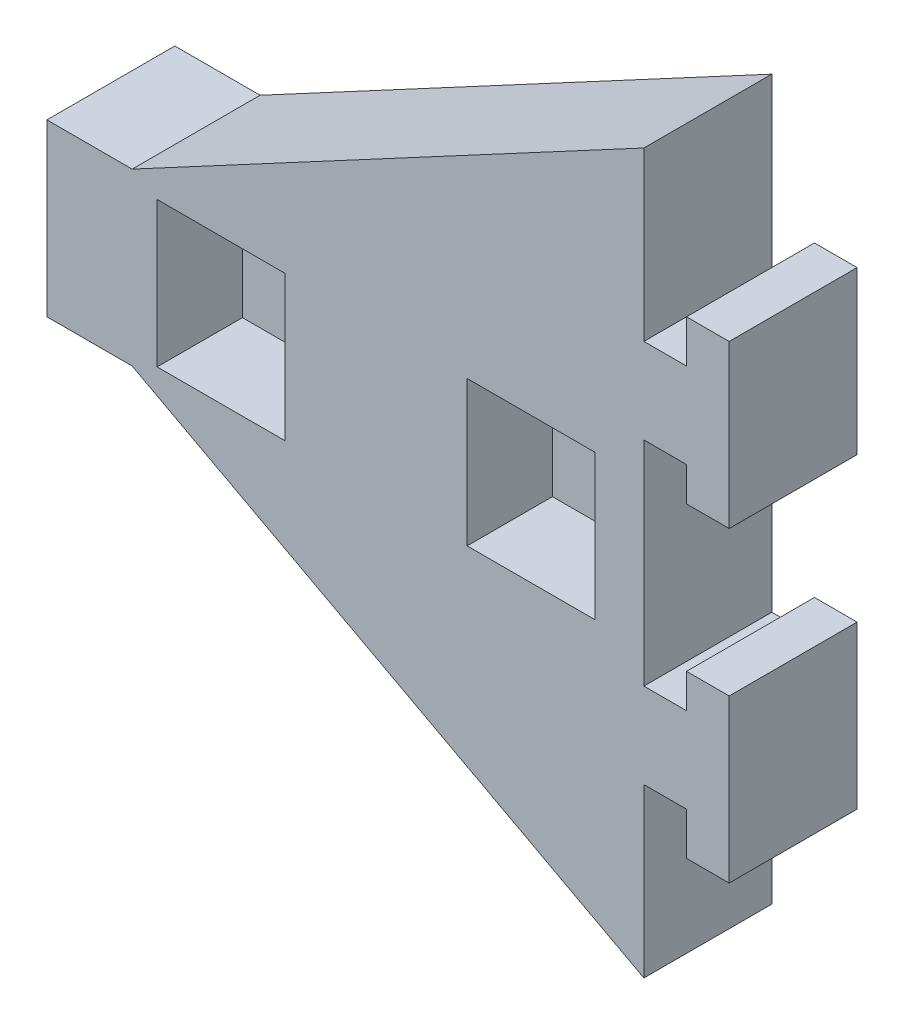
ISO-10303-21;
HEADER;
FILE_DESCRIPTION(('STEP AP214'),'2;1');
FILE_NAME('part.step','',(''),(''),'','','');
FILE_SCHEMA(('AUTOMOTIVE_DESIGN { 1 0 10303 214 1 1 1 1 }'));
ENDSEC;
DATA;
#1=APPLICATION_CONTEXT('core data for automotive mechanical design processes');
#2=APPLICATION_PROTOCOL_DEFINITION('international standard','automotive_design',2000,#1);
#3=PRODUCT_CONTEXT('',#1,'mechanical');
#4=PRODUCT('Part','Part','',(#3));
#5=PRODUCT_RELATED_PRODUCT_CATEGORY('part','',(#4));
#6=PRODUCT_DEFINITION_FORMATION('','',#4);
#7=PRODUCT_DEFINITION_CONTEXT('part definition',#1,'design');
#8=PRODUCT_DEFINITION('design','',#6,#7);
#9=PRODUCT_DEFINITION_SHAPE('','',#8);
#10=(LENGTH_UNIT() NAMED_UNIT(*) SI_UNIT(.MILLI.,.METRE.));
#11=(NAMED_UNIT(*) PLANE_ANGLE_UNIT() SI_UNIT($,.RADIAN.));
#12=(NAMED_UNIT(*) SI_UNIT($,.STERADIAN.) SOLID_ANGLE_UNIT());
#13=UNCERTAINTY_MEASURE_WITH_UNIT(LENGTH_MEASURE(1.E-05),#10,'distance_accuracy_value','');
#14=(GEOMETRIC_REPRESENTATION_CONTEXT(3) GLOBAL_UNCERTAINTY_ASSIGNED_CONTEXT((#13)) GLOBAL_UNIT_ASSIGNED_CONTEXT((#10,
#11,#12)) REPRESENTATION_CONTEXT('',''));
#15=CARTESIAN_POINT('',(0.,0.,0.));
#16=DIRECTION('',(0.,0.,1.));
#17=DIRECTION('',(1.,0.,0.));
#18=AXIS2_PLACEMENT_3D('',#15,#16,#17);
#19=CARTESIAN_POINT('',(70.,0.,15.));
#20=DIRECTION('',(-1.,0.,0.));
#21=DIRECTION('',(0.,-1.,0.));
#22=AXIS2_PLACEMENT_3D('',#19,#20,#21);
#23=PLANE('',#22);
#24=DIRECTION('',(0.,1.,0.));
#25=VECTOR('',#24,1.);
#26=CARTESIAN_POINT('',(70.,0.,15.));
#27=LINE('',#26,#25);
#28=CARTESIAN_POINT('',(70.,-39.,15.));
#29=VERTEX_POINT('',#28);
#30=CARTESIAN_POINT('',(70.,-20.,15.));
#31=VERTEX_POINT('',#30);
#32=EDGE_CURVE('E244',#29,#31,#27,.T.);
#33=ORIENTED_EDGE('',*,*,#32,.F.);
#34=DIRECTION('',(0.,0.,1.));
#35=VECTOR('',#34,1.);
#36=CARTESIAN_POINT('',(70.,-39.,0.));
#37=LINE('',#36,#35);
#38=CARTESIAN_POINT('',(70.,-39.,0.));
#39=VERTEX_POINT('',#38);
#40=EDGE_CURVE('E232',#39,#29,#37,.T.);
#41=ORIENTED_EDGE('',*,*,#40,.F.);
#42=DIRECTION('',(0.,1.,0.));
#43=VECTOR('',#42,1.);
#44=CARTESIAN_POINT('',(70.,0.,0.));
#45=LINE('',#44,#43);
#46=CARTESIAN_POINT('',(70.,-20.,0.));
#47=VERTEX_POINT('',#46);
#48=EDGE_CURVE('E242',#39,#47,#45,.T.);
#49=ORIENTED_EDGE('',*,*,#48,.T.);
#50=DIRECTION('',(0.,0.,1.));
#51=VECTOR('',#50,1.);
#52=CARTESIAN_POINT('',(70.,-20.,0.));
#53=LINE('',#52,#51);
#54=EDGE_CURVE('E304',#47,#31,#53,.T.);
#55=ORIENTED_EDGE('',*,*,#54,.T.);
#56=EDGE_LOOP('',(#33,#41,#49,#55));
#57=FACE_BOUND('',#56,.T.);
#58=ADVANCED_FACE('F34',(#57),#23,.F.);
#59=CARTESIAN_POINT('',(0.,0.,15.));
#60=DIRECTION('',(0.,0.,1.));
#61=DIRECTION('',(1.,0.,0.));
#62=AXIS2_PLACEMENT_3D('',#59,#60,#61);
#63=PLANE('',#62);
#64=DIRECTION('',(-1.,0.,0.));
#65=VECTOR('',#64,1.);
#66=CARTESIAN_POINT('',(70.,-39.,15.));
#67=LINE('',#66,#65);
#68=CARTESIAN_POINT('',(65.,-39.,15.));
#69=VERTEX_POINT('',#68);
#70=EDGE_CURVE('E49',#29,#69,#67,.T.);
#71=ORIENTED_EDGE('',*,*,#70,.F.);
#72=ORIENTED_EDGE('',*,*,#32,.T.);
#73=DIRECTION('',(-1.,0.,0.));
#74=VECTOR('',#73,1.);
#75=CARTESIAN_POINT('',(0.,-20.,15.));
#76=LINE('',#75,#74);
#77=CARTESIAN_POINT('',(65.,-20.,15.));
#78=VERTEX_POINT('',#77);
#79=EDGE_CURVE('E314',#31,#78,#76,.T.);
#80=ORIENTED_EDGE('',*,*,#79,.T.);
#81=DIRECTION('',(0.,1.,0.));
#82=VECTOR('',#81,1.);
#83=CARTESIAN_POINT('',(65.,0.,15.));
#84=LINE('',#83,#82);
#85=CARTESIAN_POINT('',(65.,-25.,15.));
#86=VERTEX_POINT('',#85);
#87=EDGE_CURVE('E317',#86,#78,#84,.T.);
#88=ORIENTED_EDGE('',*,*,#87,.F.);
#89=DIRECTION('',(-1.,0.,0.));
#90=VECTOR('',#89,1.);
#91=CARTESIAN_POINT('',(0.,-25.,15.));
#92=LINE('',#91,#90);
#93=CARTESIAN_POINT('',(60.,-25.,15.));
#94=VERTEX_POINT('',#93);
#95=EDGE_CURVE('E320',#86,#94,#92,.T.);
#96=ORIENTED_EDGE('',*,*,#95,.T.);
#97=DIRECTION('',(0.,1.,0.));
#98=VECTOR('',#97,1.);
#99=CARTESIAN_POINT('',(60.,0.,15.));
#100=LINE('',#99,#98);
#101=CARTESIAN_POINT('',(60.,-5.35714285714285,15.));
#102=VERTEX_POINT('',#101);
#103=EDGE_CURVE('E310',#94,#102,#100,.T.);
#104=ORIENTED_EDGE('',*,*,#103,.T.);
#105=DIRECTION('',(-0.881479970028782,-0.472221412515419,0.));
#106=VECTOR('',#105,1.);
#107=CARTESIAN_POINT('',(70.,0.,15.));
#108=LINE('',#107,#106);
#109=CARTESIAN_POINT('',(0.,-37.5,15.));
#110=VERTEX_POINT('',#109);
#111=EDGE_CURVE('E255',#102,#110,#108,.T.);
#112=ORIENTED_EDGE('',*,*,#111,.T.);
#113=DIRECTION('',(-1.,0.,0.));
#114=VECTOR('',#113,1.);
#115=CARTESIAN_POINT('',(0.,-37.5,15.));
#116=LINE('',#115,#114);
#117=CARTESIAN_POINT('',(-9.99999999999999,-37.5,15.));
#118=VERTEX_POINT('',#117);
#119=EDGE_CURVE('E296',#110,#118,#116,.T.);
#120=ORIENTED_EDGE('',*,*,#119,.T.);
#121=DIRECTION('',(0.,-1.,0.));
#122=VECTOR('',#121,1.);
#123=CARTESIAN_POINT('',(-9.99999999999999,-37.5,15.));
#124=LINE('',#123,#122);
#125=CARTESIAN_POINT('',(-9.99999999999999,-57.5,15.));
#126=VERTEX_POINT('',#125);
#127=EDGE_CURVE('E275',#118,#126,#124,.T.);
#128=ORIENTED_EDGE('',*,*,#127,.T.);
#129=DIRECTION('',(1.,0.,0.));
#130=VECTOR('',#129,1.);
#131=CARTESIAN_POINT('',(0.,-57.5,15.));
#132=LINE('',#131,#130);
#133=CARTESIAN_POINT('',(0.,-57.5,15.));
#134=VERTEX_POINT('',#133);
#135=EDGE_CURVE('E293',#126,#134,#132,.T.);
#136=ORIENTED_EDGE('',*,*,#135,.T.);
#137=DIRECTION('',(0.881479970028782,-0.472221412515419,0.));
#138=VECTOR('',#137,1.);
#139=CARTESIAN_POINT('',(70.,-95.,15.));
#140=LINE('',#139,#138);
#141=CARTESIAN_POINT('',(60.,-89.6428571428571,15.));
#142=VERTEX_POINT('',#141);
#143=EDGE_CURVE('E290',#134,#142,#140,.T.);
#144=ORIENTED_EDGE('',*,*,#143,.T.);
#145=DIRECTION('',(0.,1.,0.));
#146=VECTOR('',#145,1.);
#147=CARTESIAN_POINT('',(60.,0.,15.));
#148=LINE('',#147,#146);
#149=CARTESIAN_POINT('',(60.,-70.,15.));
#150=VERTEX_POINT('',#149);
#151=EDGE_CURVE('E381',#142,#150,#148,.T.);
#152=ORIENTED_EDGE('',*,*,#151,.T.);
#153=DIRECTION('',(-1.,0.,0.));
#154=VECTOR('',#153,1.);
#155=CARTESIAN_POINT('',(0.,-70.,15.));
#156=LINE('',#155,#154);
#157=CARTESIAN_POINT('',(65.,-70.,15.));
#158=VERTEX_POINT('',#157);
#159=EDGE_CURVE('E384',#158,#150,#156,.T.);
#160=ORIENTED_EDGE('',*,*,#159,.F.);
#161=DIRECTION('',(0.,1.,0.));
#162=VECTOR('',#161,1.);
#163=CARTESIAN_POINT('',(65.,0.,15.));
#164=LINE('',#163,#162);
#165=CARTESIAN_POINT('',(65.,-75.,15.));
#166=VERTEX_POINT('',#165);
#167=EDGE_CURVE('E338',#166,#158,#164,.T.);
#168=ORIENTED_EDGE('',*,*,#167,.F.);
#169=DIRECTION('',(-1.,0.,0.));
#170=VECTOR('',#169,1.);
#171=CARTESIAN_POINT('',(0.,-75.,15.));
#172=LINE('',#171,#170);
#173=CARTESIAN_POINT('',(70.,-75.,15.));
#174=VERTEX_POINT('',#173);
#175=EDGE_CURVE('E377',#174,#166,#172,.T.);
#176=ORIENTED_EDGE('',*,*,#175,.F.);
#177=CARTESIAN_POINT('',(70.,-56.,15.));
#178=VERTEX_POINT('',#177);
#179=EDGE_CURVE('E265',#174,#178,#27,.T.);
#180=ORIENTED_EDGE('',*,*,#179,.T.);
#181=DIRECTION('',(1.,0.,0.));
#182=VECTOR('',#181,1.);
#183=CARTESIAN_POINT('',(70.,-56.,15.));
#184=LINE('',#183,#182);
#185=CARTESIAN_POINT('',(65.,-56.,15.));
#186=VERTEX_POINT('',#185);
#187=EDGE_CURVE('E465',#186,#178,#184,.T.);
#188=ORIENTED_EDGE('',*,*,#187,.F.);
#189=DIRECTION('',(0.,1.,0.));
#190=VECTOR('',#189,1.);
#191=CARTESIAN_POINT('',(65.,0.,15.));
#192=LINE('',#191,#190);
#193=CARTESIAN_POINT('',(65.,-60.,15.));
#194=VERTEX_POINT('',#193);
#195=EDGE_CURVE('E339',#194,#186,#192,.T.);
#196=ORIENTED_EDGE('',*,*,#195,.F.);
#197=DIRECTION('',(-1.,0.,0.));
#198=VECTOR('',#197,1.);
#199=CARTESIAN_POINT('',(0.,-60.,15.));
#200=LINE('',#199,#198);
#201=CARTESIAN_POINT('',(60.,-60.,15.));
#202=VERTEX_POINT('',#201);
#203=EDGE_CURVE('E343',#194,#202,#200,.T.);
#204=ORIENTED_EDGE('',*,*,#203,.T.);
#205=DIRECTION('',(0.,1.,0.));
#206=VECTOR('',#205,1.);
#207=CARTESIAN_POINT('',(60.,0.,15.));
#208=LINE('',#207,#206);
#209=CARTESIAN_POINT('',(60.,-35.,15.));
#210=VERTEX_POINT('',#209);
#211=EDGE_CURVE('E346',#202,#210,#208,.T.);
#212=ORIENTED_EDGE('',*,*,#211,.T.);
#213=DIRECTION('',(1.,0.,0.));
#214=VECTOR('',#213,1.);
#215=CARTESIAN_POINT('',(0.,-35.,15.));
#216=LINE('',#215,#214);
#217=CARTESIAN_POINT('',(65.,-35.,15.));
#218=VERTEX_POINT('',#217);
#219=EDGE_CURVE('E349',#210,#218,#216,.T.);
#220=ORIENTED_EDGE('',*,*,#219,.T.);
#221=DIRECTION('',(0.,-1.,0.));
#222=VECTOR('',#221,1.);
#223=CARTESIAN_POINT('',(65.,0.,15.));
#224=LINE('',#223,#222);
#225=EDGE_CURVE('E352',#218,#69,#224,.T.);
#226=ORIENTED_EDGE('',*,*,#225,.T.);
#227=EDGE_LOOP('',(#71,#72,#80,#88,#96,#104,#112,#120,#128,#136,#144,#152,#160,#168,#176,#180,
#188,#196,#204,#212,#220,#226));
#228=FACE_BOUND('',#227,.T.);
#229=DIRECTION('',(-1.,0.,0.));
#230=VECTOR('',#229,1.);
#231=CARTESIAN_POINT('',(54.274648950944,-39.1236593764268,15.));
#232=LINE('',#231,#230);
#233=CARTESIAN_POINT('',(54.274648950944,-39.1236593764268,15.));
#234=VERTEX_POINT('',#233);
#235=CARTESIAN_POINT('',(39.274648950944,-39.1236593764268,15.));
#236=VERTEX_POINT('',#235);
#237=EDGE_CURVE('E448',#234,#236,#232,.T.);
#238=ORIENTED_EDGE('',*,*,#237,.F.);
#239=DIRECTION('',(0.,1.,0.));
#240=VECTOR('',#239,1.);
#241=CARTESIAN_POINT('',(54.274648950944,-39.1236593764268,15.));
#242=LINE('',#241,#240);
#243=CARTESIAN_POINT('',(54.274648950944,-56.1236593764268,15.));
#244=VERTEX_POINT('',#243);
#245=EDGE_CURVE('E438',#244,#234,#242,.T.);
#246=ORIENTED_EDGE('',*,*,#245,.F.);
#247=DIRECTION('',(1.,0.,0.));
#248=VECTOR('',#247,1.);
#249=CARTESIAN_POINT('',(54.274648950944,-56.1236593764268,15.));
#250=LINE('',#249,#248);
#251=CARTESIAN_POINT('',(39.274648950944,-56.1236593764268,15.));
#252=VERTEX_POINT('',#251);
#253=EDGE_CURVE('E442',#252,#244,#250,.T.);
#254=ORIENTED_EDGE('',*,*,#253,.F.);
#255=DIRECTION('',(0.,-1.,0.));
#256=VECTOR('',#255,1.);
#257=CARTESIAN_POINT('',(39.274648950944,-39.1236593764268,15.));
#258=LINE('',#257,#256);
#259=EDGE_CURVE('E445',#236,#252,#258,.T.);
#260=ORIENTED_EDGE('',*,*,#259,.F.);
#261=EDGE_LOOP('',(#238,#246,#254,#260));
#262=FACE_BOUND('',#261,.T.);
#263=DIRECTION('',(-1.,0.,0.));
#264=VECTOR('',#263,1.);
#265=CARTESIAN_POINT('',(2.92422536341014,-39.1236593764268,15.));
#266=LINE('',#265,#264);
#267=CARTESIAN_POINT('',(17.9242253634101,-39.1236593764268,15.));
#268=VERTEX_POINT('',#267);
#269=CARTESIAN_POINT('',(2.92422536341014,-39.1236593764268,15.));
#270=VERTEX_POINT('',#269);
#271=EDGE_CURVE('E407',#268,#270,#266,.T.);
#272=ORIENTED_EDGE('',*,*,#271,.F.);
#273=DIRECTION('',(0.,1.,0.));
#274=VECTOR('',#273,1.);
#275=CARTESIAN_POINT('',(17.9242253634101,-39.1236593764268,15.));
#276=LINE('',#275,#274);
#277=CARTESIAN_POINT('',(17.9242253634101,-56.1236593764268,15.));
#278=VERTEX_POINT('',#277);
#279=EDGE_CURVE('E410',#278,#268,#276,.T.);
#280=ORIENTED_EDGE('',*,*,#279,.F.);
#281=DIRECTION('',(1.,0.,0.));
#282=VECTOR('',#281,1.);
#283=CARTESIAN_POINT('',(2.92422536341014,-56.1236593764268,15.));
#284=LINE('',#283,#282);
#285=CARTESIAN_POINT('',(2.92422536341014,-56.1236593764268,15.));
#286=VERTEX_POINT('',#285);
#287=EDGE_CURVE('E413',#286,#278,#284,.T.);
#288=ORIENTED_EDGE('',*,*,#287,.F.);
#289=DIRECTION('',(0.,-1.,0.));
#290=VECTOR('',#289,1.);
#291=CARTESIAN_POINT('',(2.92422536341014,-47.6236593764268,15.));
#292=LINE('',#291,#290);
#293=EDGE_CURVE('E416',#270,#286,#292,.T.);
#294=ORIENTED_EDGE('',*,*,#293,.F.);
#295=EDGE_LOOP('',(#272,#280,#288,#294));
#296=FACE_BOUND('',#295,.T.);
#297=ADVANCED_FACE('F474',(#228,#262,#296),#63,.T.);
#298=CARTESIAN_POINT('',(0.,0.,0.));
#299=DIRECTION('',(0.,0.,1.));
#300=DIRECTION('',(1.,0.,0.));
#301=AXIS2_PLACEMENT_3D('',#298,#299,#300);
#302=PLANE('',#301);
#303=ORIENTED_EDGE('',*,*,#48,.F.);
#304=DIRECTION('',(-1.,0.,0.));
#305=VECTOR('',#304,1.);
#306=CARTESIAN_POINT('',(70.,-39.,0.));
#307=LINE('',#306,#305);
#308=CARTESIAN_POINT('',(65.,-39.,0.));
#309=VERTEX_POINT('',#308);
#310=EDGE_CURVE('E229',#39,#309,#307,.T.);
#311=ORIENTED_EDGE('',*,*,#310,.T.);
#312=DIRECTION('',(0.,-1.,0.));
#313=VECTOR('',#312,1.);
#314=CARTESIAN_POINT('',(65.,0.,0.));
#315=LINE('',#314,#313);
#316=CARTESIAN_POINT('',(65.,-35.,0.));
#317=VERTEX_POINT('',#316);
#318=EDGE_CURVE('E342',#317,#309,#315,.T.);
#319=ORIENTED_EDGE('',*,*,#318,.F.);
#320=DIRECTION('',(1.,0.,0.));
#321=VECTOR('',#320,1.);
#322=CARTESIAN_POINT('',(0.,-35.,0.));
#323=LINE('',#322,#321);
#324=CARTESIAN_POINT('',(60.,-35.,0.));
#325=VERTEX_POINT('',#324);
#326=EDGE_CURVE('E363',#325,#317,#323,.T.);
#327=ORIENTED_EDGE('',*,*,#326,.F.);
#328=DIRECTION('',(0.,1.,0.));
#329=VECTOR('',#328,1.);
#330=CARTESIAN_POINT('',(60.,0.,0.));
#331=LINE('',#330,#329);
#332=CARTESIAN_POINT('',(60.,-60.,0.));
#333=VERTEX_POINT('',#332);
#334=EDGE_CURVE('E360',#333,#325,#331,.T.);
#335=ORIENTED_EDGE('',*,*,#334,.F.);
#336=DIRECTION('',(-1.,0.,0.));
#337=VECTOR('',#336,1.);
#338=CARTESIAN_POINT('',(0.,-60.,0.));
#339=LINE('',#338,#337);
#340=CARTESIAN_POINT('',(65.,-60.,0.));
#341=VERTEX_POINT('',#340);
#342=EDGE_CURVE('E358',#341,#333,#339,.T.);
#343=ORIENTED_EDGE('',*,*,#342,.F.);
#344=DIRECTION('',(0.,1.,0.));
#345=VECTOR('',#344,1.);
#346=CARTESIAN_POINT('',(65.,0.,0.));
#347=LINE('',#346,#345);
#348=CARTESIAN_POINT('',(65.,-56.,0.));
#349=VERTEX_POINT('',#348);
#350=EDGE_CURVE('E332',#341,#349,#347,.T.);
#351=ORIENTED_EDGE('',*,*,#350,.T.);
#352=DIRECTION('',(1.,0.,0.));
#353=VECTOR('',#352,1.);
#354=CARTESIAN_POINT('',(70.,-56.,0.));
#355=LINE('',#354,#353);
#356=CARTESIAN_POINT('',(70.,-56.,0.));
#357=VERTEX_POINT('',#356);
#358=EDGE_CURVE('E57',#349,#357,#355,.T.);
#359=ORIENTED_EDGE('',*,*,#358,.T.);
#360=CARTESIAN_POINT('',(70.,-75.,0.));
#361=VERTEX_POINT('',#360);
#362=EDGE_CURVE('E251',#361,#357,#45,.T.);
#363=ORIENTED_EDGE('',*,*,#362,.F.);
#364=DIRECTION('',(-1.,0.,0.));
#365=VECTOR('',#364,1.);
#366=CARTESIAN_POINT('',(0.,-75.,0.));
#367=LINE('',#366,#365);
#368=CARTESIAN_POINT('',(65.,-75.,0.));
#369=VERTEX_POINT('',#368);
#370=EDGE_CURVE('E369',#361,#369,#367,.T.);
#371=ORIENTED_EDGE('',*,*,#370,.T.);
#372=DIRECTION('',(0.,1.,0.));
#373=VECTOR('',#372,1.);
#374=CARTESIAN_POINT('',(65.,0.,0.));
#375=LINE('',#374,#373);
#376=CARTESIAN_POINT('',(65.,-70.,0.));
#377=VERTEX_POINT('',#376);
#378=EDGE_CURVE('E380',#369,#377,#375,.T.);
#379=ORIENTED_EDGE('',*,*,#378,.T.);
#380=DIRECTION('',(-1.,0.,0.));
#381=VECTOR('',#380,1.);
#382=CARTESIAN_POINT('',(0.,-70.,0.));
#383=LINE('',#382,#381);
#384=CARTESIAN_POINT('',(60.,-70.,0.));
#385=VERTEX_POINT('',#384);
#386=EDGE_CURVE('E393',#377,#385,#383,.T.);
#387=ORIENTED_EDGE('',*,*,#386,.T.);
#388=DIRECTION('',(0.,1.,0.));
#389=VECTOR('',#388,1.);
#390=CARTESIAN_POINT('',(60.,0.,0.));
#391=LINE('',#390,#389);
#392=CARTESIAN_POINT('',(60.,-89.6428571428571,0.));
#393=VERTEX_POINT('',#392);
#394=EDGE_CURVE('E391',#393,#385,#391,.T.);
#395=ORIENTED_EDGE('',*,*,#394,.F.);
#396=DIRECTION('',(0.881479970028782,-0.472221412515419,0.));
#397=VECTOR('',#396,1.);
#398=CARTESIAN_POINT('',(70.,-95.,0.));
#399=LINE('',#398,#397);
#400=CARTESIAN_POINT('',(0.,-57.5,0.));
#401=VERTEX_POINT('',#400);
#402=EDGE_CURVE('E252',#401,#393,#399,.T.);
#403=ORIENTED_EDGE('',*,*,#402,.F.);
#404=DIRECTION('',(1.,0.,0.));
#405=VECTOR('',#404,1.);
#406=CARTESIAN_POINT('',(0.,-57.5,0.));
#407=LINE('',#406,#405);
#408=CARTESIAN_POINT('',(-9.99999999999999,-57.5,0.));
#409=VERTEX_POINT('',#408);
#410=EDGE_CURVE('E257',#409,#401,#407,.T.);
#411=ORIENTED_EDGE('',*,*,#410,.F.);
#412=DIRECTION('',(0.,-1.,0.));
#413=VECTOR('',#412,1.);
#414=CARTESIAN_POINT('',(-9.99999999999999,-37.5,0.));
#415=LINE('',#414,#413);
#416=CARTESIAN_POINT('',(-9.99999999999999,-37.5,0.));
#417=VERTEX_POINT('',#416);
#418=EDGE_CURVE('E274',#417,#409,#415,.T.);
#419=ORIENTED_EDGE('',*,*,#418,.F.);
#420=DIRECTION('',(-1.,0.,0.));
#421=VECTOR('',#420,1.);
#422=CARTESIAN_POINT('',(0.,-37.5,0.));
#423=LINE('',#422,#421);
#424=CARTESIAN_POINT('',(0.,-37.5,0.));
#425=VERTEX_POINT('',#424);
#426=EDGE_CURVE('E281',#425,#417,#423,.T.);
#427=ORIENTED_EDGE('',*,*,#426,.F.);
#428=DIRECTION('',(-0.881479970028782,-0.472221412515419,0.));
#429=VECTOR('',#428,1.);
#430=CARTESIAN_POINT('',(70.,0.,0.));
#431=LINE('',#430,#429);
#432=CARTESIAN_POINT('',(60.,-5.35714285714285,0.));
#433=VERTEX_POINT('',#432);
#434=EDGE_CURVE('E284',#433,#425,#431,.T.);
#435=ORIENTED_EDGE('',*,*,#434,.F.);
#436=DIRECTION('',(0.,1.,0.));
#437=VECTOR('',#436,1.);
#438=CARTESIAN_POINT('',(60.,0.,0.));
#439=LINE('',#438,#437);
#440=CARTESIAN_POINT('',(60.,-25.,0.));
#441=VERTEX_POINT('',#440);
#442=EDGE_CURVE('E302',#441,#433,#439,.T.);
#443=ORIENTED_EDGE('',*,*,#442,.F.);
#444=DIRECTION('',(-1.,0.,0.));
#445=VECTOR('',#444,1.);
#446=CARTESIAN_POINT('',(0.,-25.,0.));
#447=LINE('',#446,#445);
#448=CARTESIAN_POINT('',(65.,-25.,0.));
#449=VERTEX_POINT('',#448);
#450=EDGE_CURVE('E313',#449,#441,#447,.T.);
#451=ORIENTED_EDGE('',*,*,#450,.F.);
#452=DIRECTION('',(0.,1.,0.));
#453=VECTOR('',#452,1.);
#454=CARTESIAN_POINT('',(65.,0.,0.));
#455=LINE('',#454,#453);
#456=CARTESIAN_POINT('',(65.,-20.,0.));
#457=VERTEX_POINT('',#456);
#458=EDGE_CURVE('E326',#449,#457,#455,.T.);
#459=ORIENTED_EDGE('',*,*,#458,.T.);
#460=DIRECTION('',(-1.,0.,0.));
#461=VECTOR('',#460,1.);
#462=CARTESIAN_POINT('',(0.,-20.,0.));
#463=LINE('',#462,#461);
#464=EDGE_CURVE('E250',#47,#457,#463,.T.);
#465=ORIENTED_EDGE('',*,*,#464,.F.);
#466=EDGE_LOOP('',(#303,#311,#319,#327,#335,#343,#351,#359,#363,#371,#379,#387,#395,#403,#411,
#419,#427,#435,#443,#451,#459,#465));
#467=FACE_BOUND('',#466,.T.);
#468=ADVANCED_FACE('F247',(#467),#302,.F.);
#469=CARTESIAN_POINT('',(70.,-95.,15.));
#470=DIRECTION('',(0.472221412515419,0.881479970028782,0.));
#471=DIRECTION('',(-0.881479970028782,0.472221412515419,0.));
#472=AXIS2_PLACEMENT_3D('',#469,#470,#471);
#473=PLANE('',#472);
#474=DIRECTION('',(0.,0.,1.));
#475=VECTOR('',#474,1.);
#476=CARTESIAN_POINT('',(60.,-89.6428571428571,0.));
#477=LINE('',#476,#475);
#478=EDGE_CURVE('E371',#393,#142,#477,.T.);
#479=ORIENTED_EDGE('',*,*,#478,.T.);
#480=ORIENTED_EDGE('',*,*,#143,.F.);
#481=DIRECTION('',(0.,0.,-1.));
#482=VECTOR('',#481,1.);
#483=CARTESIAN_POINT('',(0.,-57.5,15.));
#484=LINE('',#483,#482);
#485=EDGE_CURVE('E261',#134,#401,#484,.T.);
#486=ORIENTED_EDGE('',*,*,#485,.T.);
#487=ORIENTED_EDGE('',*,*,#402,.T.);
#488=EDGE_LOOP('',(#479,#480,#486,#487));
#489=FACE_BOUND('',#488,.T.);
#490=ADVANCED_FACE('F517',(#489),#473,.F.);
#491=CARTESIAN_POINT('',(70.,0.,15.));
#492=DIRECTION('',(0.472221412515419,-0.881479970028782,0.));
#493=DIRECTION('',(0.881479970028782,0.472221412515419,0.));
#494=AXIS2_PLACEMENT_3D('',#491,#492,#493);
#495=PLANE('',#494);
#496=DIRECTION('',(0.,0.,1.));
#497=VECTOR('',#496,1.);
#498=CARTESIAN_POINT('',(60.,-5.35714285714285,0.));
#499=LINE('',#498,#497);
#500=EDGE_CURVE('E306',#433,#102,#499,.T.);
#501=ORIENTED_EDGE('',*,*,#500,.F.);
#502=ORIENTED_EDGE('',*,*,#434,.T.);
#503=DIRECTION('',(0.,0.,-1.));
#504=VECTOR('',#503,1.);
#505=CARTESIAN_POINT('',(0.,-37.5,15.));
#506=LINE('',#505,#504);
#507=EDGE_CURVE('E11',#110,#425,#506,.T.);
#508=ORIENTED_EDGE('',*,*,#507,.F.);
#509=ORIENTED_EDGE('',*,*,#111,.F.);
#510=EDGE_LOOP('',(#501,#502,#508,#509));
#511=FACE_BOUND('',#510,.T.);
#512=ADVANCED_FACE('F36',(#511),#495,.F.);
#513=ORIENTED_EDGE('',*,*,#362,.T.);
#514=DIRECTION('',(0.,0.,1.));
#515=VECTOR('',#514,1.);
#516=CARTESIAN_POINT('',(70.,-56.,0.));
#517=LINE('',#516,#515);
#518=EDGE_CURVE('E450',#357,#178,#517,.T.);
#519=ORIENTED_EDGE('',*,*,#518,.T.);
#520=ORIENTED_EDGE('',*,*,#179,.F.);
#521=DIRECTION('',(0.,0.,1.));
#522=VECTOR('',#521,1.);
#523=CARTESIAN_POINT('',(70.,-75.,0.));
#524=LINE('',#523,#522);
#525=EDGE_CURVE('E374',#361,#174,#524,.T.);
#526=ORIENTED_EDGE('',*,*,#525,.F.);
#527=EDGE_LOOP('',(#513,#519,#520,#526));
#528=FACE_BOUND('',#527,.T.);
#529=ADVANCED_FACE('F496',(#528),#23,.F.);
#530=CARTESIAN_POINT('',(0.,-37.5,15.));
#531=DIRECTION('',(0.,-1.,0.));
#532=DIRECTION('',(0.,0.,-1.));
#533=AXIS2_PLACEMENT_3D('',#530,#531,#532);
#534=PLANE('',#533);
#535=ORIENTED_EDGE('',*,*,#426,.T.);
#536=DIRECTION('',(0.,0.,-1.));
#537=VECTOR('',#536,1.);
#538=CARTESIAN_POINT('',(-9.99999999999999,-37.5,15.));
#539=LINE('',#538,#537);
#540=EDGE_CURVE('E42',#118,#417,#539,.T.);
#541=ORIENTED_EDGE('',*,*,#540,.F.);
#542=ORIENTED_EDGE('',*,*,#119,.F.);
#543=ORIENTED_EDGE('',*,*,#507,.T.);
#544=EDGE_LOOP('',(#535,#541,#542,#543));
#545=FACE_BOUND('',#544,.T.);
#546=ADVANCED_FACE('F532',(#545),#534,.F.);
#547=CARTESIAN_POINT('',(-9.99999999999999,-37.5,15.));
#548=DIRECTION('',(1.,0.,0.));
#549=DIRECTION('',(0.,0.,-1.));
#550=AXIS2_PLACEMENT_3D('',#547,#548,#549);
#551=PLANE('',#550);
#552=ORIENTED_EDGE('',*,*,#418,.T.);
#553=DIRECTION('',(0.,0.,-1.));
#554=VECTOR('',#553,1.);
#555=CARTESIAN_POINT('',(-9.99999999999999,-57.5,15.));
#556=LINE('',#555,#554);
#557=EDGE_CURVE('E264',#126,#409,#556,.T.);
#558=ORIENTED_EDGE('',*,*,#557,.F.);
#559=ORIENTED_EDGE('',*,*,#127,.F.);
#560=ORIENTED_EDGE('',*,*,#540,.T.);
#561=EDGE_LOOP('',(#552,#558,#559,#560));
#562=FACE_BOUND('',#561,.T.);
#563=ADVANCED_FACE('F272',(#562),#551,.F.);
#564=CARTESIAN_POINT('',(0.,-57.5,15.));
#565=DIRECTION('',(0.,1.,0.));
#566=DIRECTION('',(0.,0.,1.));
#567=AXIS2_PLACEMENT_3D('',#564,#565,#566);
#568=PLANE('',#567);
#569=ORIENTED_EDGE('',*,*,#410,.T.);
#570=ORIENTED_EDGE('',*,*,#485,.F.);
#571=ORIENTED_EDGE('',*,*,#135,.F.);
#572=ORIENTED_EDGE('',*,*,#557,.T.);
#573=EDGE_LOOP('',(#569,#570,#571,#572));
#574=FACE_BOUND('',#573,.T.);
#575=ADVANCED_FACE('F521',(#574),#568,.F.);
#576=CARTESIAN_POINT('',(0.,-25.,0.));
#577=DIRECTION('',(0.,1.,0.));
#578=DIRECTION('',(0.,0.,1.));
#579=AXIS2_PLACEMENT_3D('',#576,#577,#578);
#580=PLANE('',#579);
#581=ORIENTED_EDGE('',*,*,#95,.F.);
#582=DIRECTION('',(0.,0.,1.));
#583=VECTOR('',#582,1.);
#584=CARTESIAN_POINT('',(65.,-25.,0.));
#585=LINE('',#584,#583);
#586=EDGE_CURVE('E299',#449,#86,#585,.T.);
#587=ORIENTED_EDGE('',*,*,#586,.F.);
#588=ORIENTED_EDGE('',*,*,#450,.T.);
#589=DIRECTION('',(0.,0.,1.));
#590=VECTOR('',#589,1.);
#591=CARTESIAN_POINT('',(60.,-25.,0.));
#592=LINE('',#591,#590);
#593=EDGE_CURVE('E288',#441,#94,#592,.T.);
#594=ORIENTED_EDGE('',*,*,#593,.T.);
#595=EDGE_LOOP('',(#581,#587,#588,#594));
#596=FACE_BOUND('',#595,.T.);
#597=ADVANCED_FACE('F523',(#596),#580,.T.);
#598=CARTESIAN_POINT('',(60.,0.,0.));
#599=DIRECTION('',(1.,0.,0.));
#600=DIRECTION('',(0.,1.,0.));
#601=AXIS2_PLACEMENT_3D('',#598,#599,#600);
#602=PLANE('',#601);
#603=ORIENTED_EDGE('',*,*,#103,.F.);
#604=ORIENTED_EDGE('',*,*,#593,.F.);
#605=ORIENTED_EDGE('',*,*,#442,.T.);
#606=ORIENTED_EDGE('',*,*,#500,.T.);
#607=EDGE_LOOP('',(#603,#604,#605,#606));
#608=FACE_BOUND('',#607,.T.);
#609=ADVANCED_FACE('F529',(#608),#602,.T.);
#610=CARTESIAN_POINT('',(0.,-20.,0.));
#611=DIRECTION('',(0.,1.,0.));
#612=DIRECTION('',(0.,0.,1.));
#613=AXIS2_PLACEMENT_3D('',#610,#611,#612);
#614=PLANE('',#613);
#615=ORIENTED_EDGE('',*,*,#79,.F.);
#616=ORIENTED_EDGE('',*,*,#54,.F.);
#617=ORIENTED_EDGE('',*,*,#464,.T.);
#618=DIRECTION('',(0.,0.,1.));
#619=VECTOR('',#618,1.);
#620=CARTESIAN_POINT('',(65.,-20.,0.));
#621=LINE('',#620,#619);
#622=EDGE_CURVE('E301',#457,#78,#621,.T.);
#623=ORIENTED_EDGE('',*,*,#622,.T.);
#624=EDGE_LOOP('',(#615,#616,#617,#623));
#625=FACE_BOUND('',#624,.T.);
#626=ADVANCED_FACE('F565',(#625),#614,.T.);
#627=CARTESIAN_POINT('',(65.,0.,0.));
#628=DIRECTION('',(1.,0.,0.));
#629=DIRECTION('',(0.,0.,-1.));
#630=AXIS2_PLACEMENT_3D('',#627,#628,#629);
#631=PLANE('',#630);
#632=ORIENTED_EDGE('',*,*,#87,.T.);
#633=ORIENTED_EDGE('',*,*,#622,.F.);
#634=ORIENTED_EDGE('',*,*,#458,.F.);
#635=ORIENTED_EDGE('',*,*,#586,.T.);
#636=EDGE_LOOP('',(#632,#633,#634,#635));
#637=FACE_BOUND('',#636,.T.);
#638=ADVANCED_FACE('F562',(#637),#631,.F.);
#639=CARTESIAN_POINT('',(65.,0.,0.));
#640=DIRECTION('',(1.,0.,0.));
#641=DIRECTION('',(0.,0.,-1.));
#642=AXIS2_PLACEMENT_3D('',#639,#640,#641);
#643=PLANE('',#642);
#644=ORIENTED_EDGE('',*,*,#167,.T.);
#645=DIRECTION('',(0.,0.,1.));
#646=VECTOR('',#645,1.);
#647=CARTESIAN_POINT('',(65.,-70.,0.));
#648=LINE('',#647,#646);
#649=EDGE_CURVE('E366',#377,#158,#648,.T.);
#650=ORIENTED_EDGE('',*,*,#649,.F.);
#651=ORIENTED_EDGE('',*,*,#378,.F.);
#652=DIRECTION('',(0.,0.,1.));
#653=VECTOR('',#652,1.);
#654=CARTESIAN_POINT('',(65.,-75.,0.));
#655=LINE('',#654,#653);
#656=EDGE_CURVE('E323',#369,#166,#655,.T.);
#657=ORIENTED_EDGE('',*,*,#656,.T.);
#658=EDGE_LOOP('',(#644,#650,#651,#657));
#659=FACE_BOUND('',#658,.T.);
#660=ADVANCED_FACE('F506',(#659),#643,.F.);
#661=CARTESIAN_POINT('',(0.,-75.,0.));
#662=DIRECTION('',(0.,1.,0.));
#663=DIRECTION('',(0.,0.,1.));
#664=AXIS2_PLACEMENT_3D('',#661,#662,#663);
#665=PLANE('',#664);
#666=ORIENTED_EDGE('',*,*,#175,.T.);
#667=ORIENTED_EDGE('',*,*,#656,.F.);
#668=ORIENTED_EDGE('',*,*,#370,.F.);
#669=ORIENTED_EDGE('',*,*,#525,.T.);
#670=EDGE_LOOP('',(#666,#667,#668,#669));
#671=FACE_BOUND('',#670,.T.);
#672=ADVANCED_FACE('F501',(#671),#665,.F.);
#673=CARTESIAN_POINT('',(60.,0.,0.));
#674=DIRECTION('',(1.,0.,0.));
#675=DIRECTION('',(0.,1.,0.));
#676=AXIS2_PLACEMENT_3D('',#673,#674,#675);
#677=PLANE('',#676);
#678=ORIENTED_EDGE('',*,*,#151,.F.);
#679=ORIENTED_EDGE('',*,*,#478,.F.);
#680=ORIENTED_EDGE('',*,*,#394,.T.);
#681=DIRECTION('',(0.,0.,1.));
#682=VECTOR('',#681,1.);
#683=CARTESIAN_POINT('',(60.,-70.,0.));
#684=LINE('',#683,#682);
#685=EDGE_CURVE('E368',#385,#150,#684,.T.);
#686=ORIENTED_EDGE('',*,*,#685,.T.);
#687=EDGE_LOOP('',(#678,#679,#680,#686));
#688=FACE_BOUND('',#687,.T.);
#689=ADVANCED_FACE('F514',(#688),#677,.T.);
#690=CARTESIAN_POINT('',(0.,-70.,0.));
#691=DIRECTION('',(0.,1.,0.));
#692=DIRECTION('',(0.,0.,1.));
#693=AXIS2_PLACEMENT_3D('',#690,#691,#692);
#694=PLANE('',#693);
#695=ORIENTED_EDGE('',*,*,#159,.T.);
#696=ORIENTED_EDGE('',*,*,#685,.F.);
#697=ORIENTED_EDGE('',*,*,#386,.F.);
#698=ORIENTED_EDGE('',*,*,#649,.T.);
#699=EDGE_LOOP('',(#695,#696,#697,#698));
#700=FACE_BOUND('',#699,.T.);
#701=ADVANCED_FACE('F512',(#700),#694,.F.);
#702=CARTESIAN_POINT('',(65.,0.,0.));
#703=DIRECTION('',(-1.,0.,0.));
#704=DIRECTION('',(0.,0.,1.));
#705=AXIS2_PLACEMENT_3D('',#702,#703,#704);
#706=PLANE('',#705);
#707=DIRECTION('',(0.,0.,1.));
#708=VECTOR('',#707,1.);
#709=CARTESIAN_POINT('',(65.,-39.,0.));
#710=LINE('',#709,#708);
#711=EDGE_CURVE('E233',#309,#69,#710,.T.);
#712=ORIENTED_EDGE('',*,*,#711,.T.);
#713=ORIENTED_EDGE('',*,*,#225,.F.);
#714=DIRECTION('',(0.,0.,1.));
#715=VECTOR('',#714,1.);
#716=CARTESIAN_POINT('',(65.,-35.,0.));
#717=LINE('',#716,#715);
#718=EDGE_CURVE('E329',#317,#218,#717,.T.);
#719=ORIENTED_EDGE('',*,*,#718,.F.);
#720=ORIENTED_EDGE('',*,*,#318,.T.);
#721=EDGE_LOOP('',(#712,#713,#719,#720));
#722=FACE_BOUND('',#721,.T.);
#723=ADVANCED_FACE('F471',(#722),#706,.T.);
#724=CARTESIAN_POINT('',(65.,0.,0.));
#725=DIRECTION('',(1.,0.,0.));
#726=DIRECTION('',(0.,0.,-1.));
#727=AXIS2_PLACEMENT_3D('',#724,#725,#726);
#728=PLANE('',#727);
#729=ORIENTED_EDGE('',*,*,#195,.T.);
#730=DIRECTION('',(0.,0.,1.));
#731=VECTOR('',#730,1.);
#732=CARTESIAN_POINT('',(65.,-56.,0.));
#733=LINE('',#732,#731);
#734=EDGE_CURVE('E461',#349,#186,#733,.T.);
#735=ORIENTED_EDGE('',*,*,#734,.F.);
#736=ORIENTED_EDGE('',*,*,#350,.F.);
#737=DIRECTION('',(0.,0.,1.));
#738=VECTOR('',#737,1.);
#739=CARTESIAN_POINT('',(65.,-60.,0.));
#740=LINE('',#739,#738);
#741=EDGE_CURVE('E336',#341,#194,#740,.T.);
#742=ORIENTED_EDGE('',*,*,#741,.T.);
#743=EDGE_LOOP('',(#729,#735,#736,#742));
#744=FACE_BOUND('',#743,.T.);
#745=ADVANCED_FACE('F492',(#744),#728,.F.);
#746=CARTESIAN_POINT('',(0.,-60.,0.));
#747=DIRECTION('',(0.,1.,0.));
#748=DIRECTION('',(0.,0.,1.));
#749=AXIS2_PLACEMENT_3D('',#746,#747,#748);
#750=PLANE('',#749);
#751=ORIENTED_EDGE('',*,*,#203,.F.);
#752=ORIENTED_EDGE('',*,*,#741,.F.);
#753=ORIENTED_EDGE('',*,*,#342,.T.);
#754=DIRECTION('',(0.,0.,1.));
#755=VECTOR('',#754,1.);
#756=CARTESIAN_POINT('',(60.,-60.,0.));
#757=LINE('',#756,#755);
#758=EDGE_CURVE('E334',#333,#202,#757,.T.);
#759=ORIENTED_EDGE('',*,*,#758,.T.);
#760=EDGE_LOOP('',(#751,#752,#753,#759));
#761=FACE_BOUND('',#760,.T.);
#762=ADVANCED_FACE('F488',(#761),#750,.T.);
#763=CARTESIAN_POINT('',(60.,0.,0.));
#764=DIRECTION('',(1.,0.,0.));
#765=DIRECTION('',(0.,1.,0.));
#766=AXIS2_PLACEMENT_3D('',#763,#764,#765);
#767=PLANE('',#766);
#768=ORIENTED_EDGE('',*,*,#211,.F.);
#769=ORIENTED_EDGE('',*,*,#758,.F.);
#770=ORIENTED_EDGE('',*,*,#334,.T.);
#771=DIRECTION('',(0.,0.,1.));
#772=VECTOR('',#771,1.);
#773=CARTESIAN_POINT('',(60.,-35.,0.));
#774=LINE('',#773,#772);
#775=EDGE_CURVE('E331',#325,#210,#774,.T.);
#776=ORIENTED_EDGE('',*,*,#775,.T.);
#777=EDGE_LOOP('',(#768,#769,#770,#776));
#778=FACE_BOUND('',#777,.T.);
#779=ADVANCED_FACE('F485',(#778),#767,.T.);
#780=CARTESIAN_POINT('',(0.,-35.,0.));
#781=DIRECTION('',(0.,-1.,0.));
#782=DIRECTION('',(0.,0.,-1.));
#783=AXIS2_PLACEMENT_3D('',#780,#781,#782);
#784=PLANE('',#783);
#785=ORIENTED_EDGE('',*,*,#219,.F.);
#786=ORIENTED_EDGE('',*,*,#775,.F.);
#787=ORIENTED_EDGE('',*,*,#326,.T.);
#788=ORIENTED_EDGE('',*,*,#718,.T.);
#789=EDGE_LOOP('',(#785,#786,#787,#788));
#790=FACE_BOUND('',#789,.T.);
#791=ADVANCED_FACE('F479',(#790),#784,.T.);
#792=CARTESIAN_POINT('',(2.92422536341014,-39.1236593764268,5.));
#793=DIRECTION('',(0.,1.,0.));
#794=DIRECTION('',(0.,0.,1.));
#795=AXIS2_PLACEMENT_3D('',#792,#793,#794);
#796=PLANE('',#795);
#797=ORIENTED_EDGE('',*,*,#271,.T.);
#798=DIRECTION('',(0.,0.,1.));
#799=VECTOR('',#798,1.);
#800=CARTESIAN_POINT('',(2.92422536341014,-39.1236593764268,5.));
#801=LINE('',#800,#799);
#802=CARTESIAN_POINT('',(2.92422536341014,-39.1236593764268,5.));
#803=VERTEX_POINT('',#802);
#804=EDGE_CURVE('E355',#803,#270,#801,.T.);
#805=ORIENTED_EDGE('',*,*,#804,.F.);
#806=DIRECTION('',(-1.,0.,0.));
#807=VECTOR('',#806,1.);
#808=CARTESIAN_POINT('',(2.92422536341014,-39.1236593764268,5.));
#809=LINE('',#808,#807);
#810=CARTESIAN_POINT('',(17.9242253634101,-39.1236593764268,5.));
#811=VERTEX_POINT('',#810);
#812=EDGE_CURVE('E401',#811,#803,#809,.T.);
#813=ORIENTED_EDGE('',*,*,#812,.F.);
#814=DIRECTION('',(0.,0.,1.));
#815=VECTOR('',#814,1.);
#816=CARTESIAN_POINT('',(17.9242253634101,-39.1236593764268,5.));
#817=LINE('',#816,#815);
#818=EDGE_CURVE('E403',#811,#268,#817,.T.);
#819=ORIENTED_EDGE('',*,*,#818,.T.);
#820=EDGE_LOOP('',(#797,#805,#813,#819));
#821=FACE_BOUND('',#820,.T.);
#822=ADVANCED_FACE('F677',(#821),#796,.F.);
#823=CARTESIAN_POINT('',(17.9242253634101,-39.1236593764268,5.));
#824=DIRECTION('',(1.,0.,0.));
#825=DIRECTION('',(0.,0.,-1.));
#826=AXIS2_PLACEMENT_3D('',#823,#824,#825);
#827=PLANE('',#826);
#828=ORIENTED_EDGE('',*,*,#279,.T.);
#829=ORIENTED_EDGE('',*,*,#818,.F.);
#830=DIRECTION('',(0.,1.,0.));
#831=VECTOR('',#830,1.);
#832=CARTESIAN_POINT('',(17.9242253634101,-39.1236593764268,5.));
#833=LINE('',#832,#831);
#834=CARTESIAN_POINT('',(17.9242253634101,-56.1236593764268,5.));
#835=VERTEX_POINT('',#834);
#836=EDGE_CURVE('E422',#835,#811,#833,.T.);
#837=ORIENTED_EDGE('',*,*,#836,.F.);
#838=DIRECTION('',(0.,0.,1.));
#839=VECTOR('',#838,1.);
#840=CARTESIAN_POINT('',(17.9242253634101,-56.1236593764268,5.));
#841=LINE('',#840,#839);
#842=EDGE_CURVE('E400',#835,#278,#841,.T.);
#843=ORIENTED_EDGE('',*,*,#842,.T.);
#844=EDGE_LOOP('',(#828,#829,#837,#843));
#845=FACE_BOUND('',#844,.T.);
#846=ADVANCED_FACE('F686',(#845),#827,.F.);
#847=CARTESIAN_POINT('',(2.92422536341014,-56.1236593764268,5.));
#848=DIRECTION('',(0.,-1.,0.));
#849=DIRECTION('',(0.,0.,-1.));
#850=AXIS2_PLACEMENT_3D('',#847,#848,#849);
#851=PLANE('',#850);
#852=ORIENTED_EDGE('',*,*,#287,.T.);
#853=ORIENTED_EDGE('',*,*,#842,.F.);
#854=DIRECTION('',(1.,0.,0.));
#855=VECTOR('',#854,1.);
#856=CARTESIAN_POINT('',(2.92422536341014,-56.1236593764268,5.));
#857=LINE('',#856,#855);
#858=CARTESIAN_POINT('',(2.92422536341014,-56.1236593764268,5.));
#859=VERTEX_POINT('',#858);
#860=EDGE_CURVE('E425',#859,#835,#857,.T.);
#861=ORIENTED_EDGE('',*,*,#860,.F.);
#862=DIRECTION('',(0.,0.,1.));
#863=VECTOR('',#862,1.);
#864=CARTESIAN_POINT('',(2.92422536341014,-56.1236593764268,5.));
#865=LINE('',#864,#863);
#866=EDGE_CURVE('E398',#859,#286,#865,.T.);
#867=ORIENTED_EDGE('',*,*,#866,.T.);
#868=EDGE_LOOP('',(#852,#853,#861,#867));
#869=FACE_BOUND('',#868,.T.);
#870=ADVANCED_FACE('F696',(#869),#851,.F.);
#871=CARTESIAN_POINT('',(2.92422536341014,-47.6236593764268,5.));
#872=DIRECTION('',(-1.,0.,0.));
#873=DIRECTION('',(0.,0.,1.));
#874=AXIS2_PLACEMENT_3D('',#871,#872,#873);
#875=PLANE('',#874);
#876=ORIENTED_EDGE('',*,*,#293,.T.);
#877=ORIENTED_EDGE('',*,*,#866,.F.);
#878=DIRECTION('',(0.,-1.,0.));
#879=VECTOR('',#878,1.);
#880=CARTESIAN_POINT('',(2.92422536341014,-47.6236593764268,5.));
#881=LINE('',#880,#879);
#882=EDGE_CURVE('E409',#803,#859,#881,.T.);
#883=ORIENTED_EDGE('',*,*,#882,.F.);
#884=ORIENTED_EDGE('',*,*,#804,.T.);
#885=EDGE_LOOP('',(#876,#877,#883,#884));
#886=FACE_BOUND('',#885,.T.);
#887=ADVANCED_FACE('F706',(#886),#875,.F.);
#888=CARTESIAN_POINT('',(0.,0.,5.));
#889=DIRECTION('',(0.,0.,-1.));
#890=DIRECTION('',(-1.,0.,0.));
#891=AXIS2_PLACEMENT_3D('',#888,#889,#890);
#892=PLANE('',#891);
#893=ORIENTED_EDGE('',*,*,#882,.T.);
#894=ORIENTED_EDGE('',*,*,#860,.T.);
#895=ORIENTED_EDGE('',*,*,#836,.T.);
#896=ORIENTED_EDGE('',*,*,#812,.T.);
#897=EDGE_LOOP('',(#893,#894,#895,#896));
#898=FACE_BOUND('',#897,.T.);
#899=ADVANCED_FACE('F717',(#898),#892,.F.);
#900=CARTESIAN_POINT('',(54.274648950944,-39.1236593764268,5.));
#901=DIRECTION('',(0.,1.,0.));
#902=DIRECTION('',(0.,0.,1.));
#903=AXIS2_PLACEMENT_3D('',#900,#901,#902);
#904=PLANE('',#903);
#905=ORIENTED_EDGE('',*,*,#237,.T.);
#906=DIRECTION('',(0.,0.,1.));
#907=VECTOR('',#906,1.);
#908=CARTESIAN_POINT('',(39.274648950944,-39.1236593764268,5.));
#909=LINE('',#908,#907);
#910=CARTESIAN_POINT('',(39.274648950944,-39.1236593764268,5.));
#911=VERTEX_POINT('',#910);
#912=EDGE_CURVE('E429',#911,#236,#909,.T.);
#913=ORIENTED_EDGE('',*,*,#912,.F.);
#914=DIRECTION('',(-1.,0.,0.));
#915=VECTOR('',#914,1.);
#916=CARTESIAN_POINT('',(54.274648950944,-39.1236593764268,5.));
#917=LINE('',#916,#915);
#918=CARTESIAN_POINT('',(54.274648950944,-39.1236593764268,5.));
#919=VERTEX_POINT('',#918);
#920=EDGE_CURVE('E441',#919,#911,#917,.T.);
#921=ORIENTED_EDGE('',*,*,#920,.F.);
#922=DIRECTION('',(0.,0.,1.));
#923=VECTOR('',#922,1.);
#924=CARTESIAN_POINT('',(54.274648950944,-39.1236593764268,5.));
#925=LINE('',#924,#923);
#926=EDGE_CURVE('E419',#919,#234,#925,.T.);
#927=ORIENTED_EDGE('',*,*,#926,.T.);
#928=EDGE_LOOP('',(#905,#913,#921,#927));
#929=FACE_BOUND('',#928,.T.);
#930=ADVANCED_FACE('F727',(#929),#904,.F.);
#931=CARTESIAN_POINT('',(54.274648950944,-39.1236593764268,5.));
#932=DIRECTION('',(1.,0.,0.));
#933=DIRECTION('',(0.,0.,-1.));
#934=AXIS2_PLACEMENT_3D('',#931,#932,#933);
#935=PLANE('',#934);
#936=ORIENTED_EDGE('',*,*,#245,.T.);
#937=ORIENTED_EDGE('',*,*,#926,.F.);
#938=DIRECTION('',(0.,1.,0.));
#939=VECTOR('',#938,1.);
#940=CARTESIAN_POINT('',(54.274648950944,-39.1236593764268,5.));
#941=LINE('',#940,#939);
#942=CARTESIAN_POINT('',(54.274648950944,-56.1236593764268,5.));
#943=VERTEX_POINT('',#942);
#944=EDGE_CURVE('E433',#943,#919,#941,.T.);
#945=ORIENTED_EDGE('',*,*,#944,.F.);
#946=DIRECTION('',(0.,0.,1.));
#947=VECTOR('',#946,1.);
#948=CARTESIAN_POINT('',(54.274648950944,-56.1236593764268,5.));
#949=LINE('',#948,#947);
#950=EDGE_CURVE('E435',#943,#244,#949,.T.);
#951=ORIENTED_EDGE('',*,*,#950,.T.);
#952=EDGE_LOOP('',(#936,#937,#945,#951));
#953=FACE_BOUND('',#952,.T.);
#954=ADVANCED_FACE('F737',(#953),#935,.F.);
#955=CARTESIAN_POINT('',(54.274648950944,-56.1236593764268,5.));
#956=DIRECTION('',(0.,-1.,0.));
#957=DIRECTION('',(1.,0.,0.));
#958=AXIS2_PLACEMENT_3D('',#955,#956,#957);
#959=PLANE('',#958);
#960=ORIENTED_EDGE('',*,*,#253,.T.);
#961=ORIENTED_EDGE('',*,*,#950,.F.);
#962=DIRECTION('',(1.,0.,0.));
#963=VECTOR('',#962,1.);
#964=CARTESIAN_POINT('',(54.274648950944,-56.1236593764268,5.));
#965=LINE('',#964,#963);
#966=CARTESIAN_POINT('',(39.274648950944,-56.1236593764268,5.));
#967=VERTEX_POINT('',#966);
#968=EDGE_CURVE('E453',#967,#943,#965,.T.);
#969=ORIENTED_EDGE('',*,*,#968,.F.);
#970=DIRECTION('',(0.,0.,1.));
#971=VECTOR('',#970,1.);
#972=CARTESIAN_POINT('',(39.274648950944,-56.1236593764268,5.));
#973=LINE('',#972,#971);
#974=EDGE_CURVE('E432',#967,#252,#973,.T.);
#975=ORIENTED_EDGE('',*,*,#974,.T.);
#976=EDGE_LOOP('',(#960,#961,#969,#975));
#977=FACE_BOUND('',#976,.T.);
#978=ADVANCED_FACE('F747',(#977),#959,.F.);
#979=CARTESIAN_POINT('',(39.274648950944,-39.1236593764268,5.));
#980=DIRECTION('',(-1.,0.,0.));
#981=DIRECTION('',(0.,0.,1.));
#982=AXIS2_PLACEMENT_3D('',#979,#980,#981);
#983=PLANE('',#982);
#984=ORIENTED_EDGE('',*,*,#259,.T.);
#985=ORIENTED_EDGE('',*,*,#974,.F.);
#986=DIRECTION('',(0.,-1.,0.));
#987=VECTOR('',#986,1.);
#988=CARTESIAN_POINT('',(39.274648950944,-39.1236593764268,5.));
#989=LINE('',#988,#987);
#990=EDGE_CURVE('E456',#911,#967,#989,.T.);
#991=ORIENTED_EDGE('',*,*,#990,.F.);
#992=ORIENTED_EDGE('',*,*,#912,.T.);
#993=EDGE_LOOP('',(#984,#985,#991,#992));
#994=FACE_BOUND('',#993,.T.);
#995=ADVANCED_FACE('F757',(#994),#983,.F.);
#996=CARTESIAN_POINT('',(0.,0.,5.));
#997=DIRECTION('',(0.,0.,1.));
#998=DIRECTION('',(1.,0.,0.));
#999=AXIS2_PLACEMENT_3D('',#996,#997,#998);
#1000=PLANE('',#999);
#1001=ORIENTED_EDGE('',*,*,#920,.T.);
#1002=ORIENTED_EDGE('',*,*,#990,.T.);
#1003=ORIENTED_EDGE('',*,*,#968,.T.);
#1004=ORIENTED_EDGE('',*,*,#944,.T.);
#1005=EDGE_LOOP('',(#1001,#1002,#1003,#1004));
#1006=FACE_BOUND('',#1005,.T.);
#1007=ADVANCED_FACE('F767',(#1006),#1000,.T.);
#1008=CARTESIAN_POINT('',(70.,-56.,0.));
#1009=DIRECTION('',(0.,-1.,0.));
#1010=DIRECTION('',(0.,0.,-1.));
#1011=AXIS2_PLACEMENT_3D('',#1008,#1009,#1010);
#1012=PLANE('',#1011);
#1013=ORIENTED_EDGE('',*,*,#187,.T.);
#1014=ORIENTED_EDGE('',*,*,#518,.F.);
#1015=ORIENTED_EDGE('',*,*,#358,.F.);
#1016=ORIENTED_EDGE('',*,*,#734,.T.);
#1017=EDGE_LOOP('',(#1013,#1014,#1015,#1016));
#1018=FACE_BOUND('',#1017,.T.);
#1019=ADVANCED_FACE('F776',(#1018),#1012,.F.);
#1020=CARTESIAN_POINT('',(70.,-39.,0.));
#1021=DIRECTION('',(0.,1.,0.));
#1022=DIRECTION('',(0.,0.,1.));
#1023=AXIS2_PLACEMENT_3D('',#1020,#1021,#1022);
#1024=PLANE('',#1023);
#1025=ORIENTED_EDGE('',*,*,#70,.T.);
#1026=ORIENTED_EDGE('',*,*,#711,.F.);
#1027=ORIENTED_EDGE('',*,*,#310,.F.);
#1028=ORIENTED_EDGE('',*,*,#40,.T.);
#1029=EDGE_LOOP('',(#1025,#1026,#1027,#1028));
#1030=FACE_BOUND('',#1029,.T.);
#1031=ADVANCED_FACE('F231',(#1030),#1024,.F.);
#1032=CLOSED_SHELL('',(#58,#297,#468,#490,#512,#529,#546,#563,#575,#597,#609,#626,#638,#660,
#672,#689,#701,#723,#745,#762,#779,#791,#822,#846,#870,#887,#899,#930,#954,#978,#995,#1007,
#1019,#1031));
#1033=MANIFOLD_SOLID_BREP('B2',#1032);
#1034=ADVANCED_BREP_SHAPE_REPRESENTATION('',(#18,#1033),#14);
#1035=SHAPE_DEFINITION_REPRESENTATION(#9,#1034);
ENDSEC;
END-ISO-10303-21;
